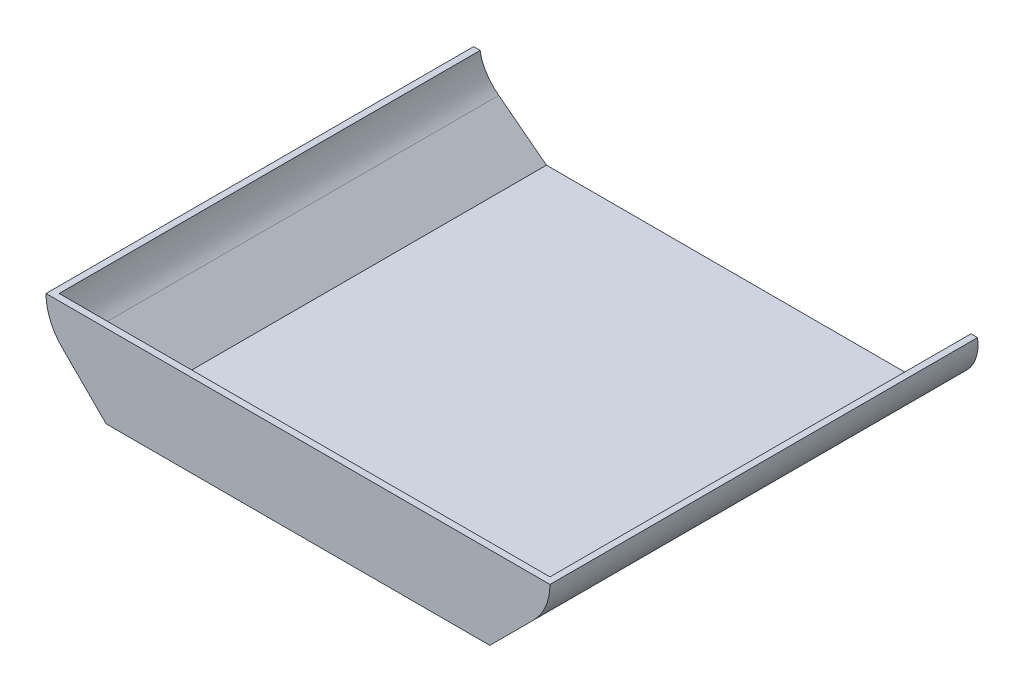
ISO-10303-21;
HEADER;
FILE_DESCRIPTION(('STEP AP214'),'2;1');
FILE_NAME('part.step','',(''),(''),'','','');
FILE_SCHEMA(('AUTOMOTIVE_DESIGN { 1 0 10303 214 1 1 1 1 }'));
ENDSEC;
DATA;
#1=APPLICATION_CONTEXT('core data for automotive mechanical design processes');
#2=APPLICATION_PROTOCOL_DEFINITION('international standard','automotive_design',2000,#1);
#3=PRODUCT_CONTEXT('',#1,'mechanical');
#4=PRODUCT('Part','Part','',(#3));
#5=PRODUCT_RELATED_PRODUCT_CATEGORY('part','',(#4));
#6=PRODUCT_DEFINITION_FORMATION('','',#4);
#7=PRODUCT_DEFINITION_CONTEXT('part definition',#1,'design');
#8=PRODUCT_DEFINITION('design','',#6,#7);
#9=PRODUCT_DEFINITION_SHAPE('','',#8);
#10=(LENGTH_UNIT() NAMED_UNIT(*) SI_UNIT(.MILLI.,.METRE.));
#11=(NAMED_UNIT(*) PLANE_ANGLE_UNIT() SI_UNIT($,.RADIAN.));
#12=(NAMED_UNIT(*) SI_UNIT($,.STERADIAN.) SOLID_ANGLE_UNIT());
#13=UNCERTAINTY_MEASURE_WITH_UNIT(LENGTH_MEASURE(1.E-05),#10,'distance_accuracy_value','');
#14=(GEOMETRIC_REPRESENTATION_CONTEXT(3) GLOBAL_UNCERTAINTY_ASSIGNED_CONTEXT((#13)) GLOBAL_UNIT_ASSIGNED_CONTEXT((#10,
#11,#12)) REPRESENTATION_CONTEXT('',''));
#15=CARTESIAN_POINT('',(0.,0.,0.));
#16=DIRECTION('',(0.,0.,1.));
#17=DIRECTION('',(1.,0.,0.));
#18=AXIS2_PLACEMENT_3D('',#15,#16,#17);
#19=CARTESIAN_POINT('',(175.,0.,400.));
#20=DIRECTION('',(-0.707106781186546,0.707106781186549,0.));
#21=DIRECTION('',(-0.707106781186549,-0.707106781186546,0.));
#22=AXIS2_PLACEMENT_3D('',#19,#20,#21);
#23=PLANE('',#22);
#24=DIRECTION('',(-0.704062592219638,-0.704062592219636,-0.0926915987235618));
#25=VECTOR('',#24,1.);
#26=CARTESIAN_POINT('',(201.104274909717,26.1042749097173,3.43669298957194));
#27=LINE('',#26,#25);
#28=CARTESIAN_POINT('',(215.218833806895,40.2188338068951,5.29490992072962));
#29=VERTEX_POINT('',#28);
#30=CARTESIAN_POINT('',(175.,0.,0.));
#31=VERTEX_POINT('',#30);
#32=EDGE_CURVE('E190',#29,#31,#27,.T.);
#33=ORIENTED_EDGE('',*,*,#32,.F.);
#34=DIRECTION('',(0.,0.,-1.));
#35=VECTOR('',#34,1.);
#36=CARTESIAN_POINT('',(215.218833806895,40.2188338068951,400.));
#37=LINE('',#36,#35);
#38=CARTESIAN_POINT('',(215.218833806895,40.2188338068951,400.));
#39=VERTEX_POINT('',#38);
#40=EDGE_CURVE('E11',#39,#29,#37,.T.);
#41=ORIENTED_EDGE('',*,*,#40,.F.);
#42=DIRECTION('',(0.707106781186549,0.707106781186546,0.));
#43=VECTOR('',#42,1.);
#44=CARTESIAN_POINT('',(175.,0.,400.));
#45=LINE('',#44,#43);
#46=CARTESIAN_POINT('',(175.,0.,400.));
#47=VERTEX_POINT('',#46);
#48=EDGE_CURVE('E194',#47,#39,#45,.T.);
#49=ORIENTED_EDGE('',*,*,#48,.F.);
#50=DIRECTION('',(0.,0.,-1.));
#51=VECTOR('',#50,1.);
#52=CARTESIAN_POINT('',(175.,0.,400.));
#53=LINE('',#52,#51);
#54=EDGE_CURVE('E204',#47,#31,#53,.T.);
#55=ORIENTED_EDGE('',*,*,#54,.T.);
#56=EDGE_LOOP('',(#33,#41,#49,#55));
#57=FACE_BOUND('',#56,.T.);
#58=ADVANCED_FACE('F39',(#57),#23,.F.);
#59=CARTESIAN_POINT('',(179.863494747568,75.5741728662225,400.));
#60=DIRECTION('',(0.,0.,-1.));
#61=DIRECTION('',(-1.,0.,0.));
#62=AXIS2_PLACEMENT_3D('',#59,#60,#61);
#63=CYLINDRICAL_SURFACE('',#62,50.);
#64=CARTESIAN_POINT('',(179.863494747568,75.5741728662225,9.94952861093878));
#65=DIRECTION('',(0.,0.130526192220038,-0.991444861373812));
#66=DIRECTION('',(0.,-0.991444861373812,-0.130526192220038));
#67=AXIS2_PLACEMENT_3D('',#64,#65,#66);
#68=ELLIPSE('',#67,50.4314480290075,50.);
#69=CARTESIAN_POINT('',(229.863494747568,75.5741721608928,9.94952851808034));
#70=VERTEX_POINT('',#69);
#71=EDGE_CURVE('E188',#70,#29,#68,.T.);
#72=ORIENTED_EDGE('',*,*,#71,.F.);
#73=DIRECTION('',(0.,0.,-1.));
#74=VECTOR('',#73,1.);
#75=CARTESIAN_POINT('',(229.863494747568,75.5741720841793,400.));
#76=LINE('',#75,#74);
#77=CARTESIAN_POINT('',(229.863494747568,75.5741720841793,400.));
#78=VERTEX_POINT('',#77);
#79=EDGE_CURVE('E47',#78,#70,#76,.T.);
#80=ORIENTED_EDGE('',*,*,#79,.F.);
#81=CARTESIAN_POINT('',(179.863494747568,75.5741728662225,400.));
#82=DIRECTION('',(0.,0.,1.));
#83=DIRECTION('',(1.,0.,0.));
#84=AXIS2_PLACEMENT_3D('',#81,#82,#83);
#85=CIRCLE('',#84,50.);
#86=EDGE_CURVE('E196',#39,#78,#85,.T.);
#87=ORIENTED_EDGE('',*,*,#86,.F.);
#88=ORIENTED_EDGE('',*,*,#40,.T.);
#89=EDGE_LOOP('',(#72,#80,#87,#88));
#90=FACE_BOUND('',#89,.T.);
#91=ADVANCED_FACE('F229',(#90),#63,.T.);
#92=CARTESIAN_POINT('',(-179.863494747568,75.5741728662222,400.));
#93=DIRECTION('',(0.,0.,-1.));
#94=DIRECTION('',(-1.,0.,0.));
#95=AXIS2_PLACEMENT_3D('',#92,#93,#94);
#96=CYLINDRICAL_SURFACE('',#95,50.);
#97=CARTESIAN_POINT('',(-179.863494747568,75.5741728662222,9.94952861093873));
#98=DIRECTION('',(0.,0.130526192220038,-0.991444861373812));
#99=DIRECTION('',(0.,-0.991444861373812,-0.130526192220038));
#100=AXIS2_PLACEMENT_3D('',#97,#98,#99);
#101=ELLIPSE('',#100,50.4314480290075,50.);
#102=CARTESIAN_POINT('',(-215.218833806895,40.2188338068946,5.29490992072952));
#103=VERTEX_POINT('',#102);
#104=CARTESIAN_POINT('',(-229.863494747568,75.5741721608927,9.94952851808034));
#105=VERTEX_POINT('',#104);
#106=EDGE_CURVE('E185',#103,#105,#101,.T.);
#107=ORIENTED_EDGE('',*,*,#106,.F.);
#108=DIRECTION('',(0.,0.,-1.));
#109=VECTOR('',#108,1.);
#110=CARTESIAN_POINT('',(-215.218833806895,40.2188338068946,400.));
#111=LINE('',#110,#109);
#112=CARTESIAN_POINT('',(-215.218833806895,40.2188338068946,400.));
#113=VERTEX_POINT('',#112);
#114=EDGE_CURVE('E212',#113,#103,#111,.T.);
#115=ORIENTED_EDGE('',*,*,#114,.F.);
#116=CARTESIAN_POINT('',(-179.863494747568,75.5741728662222,400.));
#117=DIRECTION('',(0.,0.,1.));
#118=DIRECTION('',(-1.,0.,0.));
#119=AXIS2_PLACEMENT_3D('',#116,#117,#118);
#120=CIRCLE('',#119,50.);
#121=CARTESIAN_POINT('',(-229.863494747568,75.5741720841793,400.));
#122=VERTEX_POINT('',#121);
#123=EDGE_CURVE('E199',#122,#113,#120,.T.);
#124=ORIENTED_EDGE('',*,*,#123,.F.);
#125=DIRECTION('',(0.,0.,-1.));
#126=VECTOR('',#125,1.);
#127=CARTESIAN_POINT('',(-229.863494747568,75.5741720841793,400.));
#128=LINE('',#127,#126);
#129=EDGE_CURVE('E215',#122,#105,#128,.T.);
#130=ORIENTED_EDGE('',*,*,#129,.T.);
#131=EDGE_LOOP('',(#107,#115,#124,#130));
#132=FACE_BOUND('',#131,.T.);
#133=ADVANCED_FACE('F243',(#132),#96,.T.);
#134=CARTESIAN_POINT('',(-175.,0.,400.));
#135=DIRECTION('',(0.707106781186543,0.707106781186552,0.));
#136=DIRECTION('',(-0.707106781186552,0.707106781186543,0.));
#137=AXIS2_PLACEMENT_3D('',#134,#135,#136);
#138=PLANE('',#137);
#139=DIRECTION('',(-0.704062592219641,0.704062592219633,0.0926915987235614));
#140=VECTOR('',#139,1.);
#141=CARTESIAN_POINT('',(-201.104274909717,26.1042749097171,3.43669298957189));
#142=LINE('',#141,#140);
#143=CARTESIAN_POINT('',(-175.,0.,0.));
#144=VERTEX_POINT('',#143);
#145=EDGE_CURVE('E183',#144,#103,#142,.T.);
#146=ORIENTED_EDGE('',*,*,#145,.F.);
#147=DIRECTION('',(0.,0.,-1.));
#148=VECTOR('',#147,1.);
#149=CARTESIAN_POINT('',(-175.,0.,400.));
#150=LINE('',#149,#148);
#151=CARTESIAN_POINT('',(-175.,0.,400.));
#152=VERTEX_POINT('',#151);
#153=EDGE_CURVE('E209',#152,#144,#150,.T.);
#154=ORIENTED_EDGE('',*,*,#153,.F.);
#155=DIRECTION('',(0.707106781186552,-0.707106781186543,0.));
#156=VECTOR('',#155,1.);
#157=CARTESIAN_POINT('',(-175.,0.,400.));
#158=LINE('',#157,#156);
#159=EDGE_CURVE('E201',#113,#152,#158,.T.);
#160=ORIENTED_EDGE('',*,*,#159,.F.);
#161=ORIENTED_EDGE('',*,*,#114,.T.);
#162=EDGE_LOOP('',(#146,#154,#160,#161));
#163=FACE_BOUND('',#162,.T.);
#164=ADVANCED_FACE('F239',(#163),#138,.F.);
#165=CARTESIAN_POINT('',(-175.,0.,400.));
#166=DIRECTION('',(0.,1.,0.));
#167=DIRECTION('',(-1.,0.,0.));
#168=AXIS2_PLACEMENT_3D('',#165,#166,#167);
#169=PLANE('',#168);
#170=DIRECTION('',(1.,0.,0.));
#171=VECTOR('',#170,1.);
#172=CARTESIAN_POINT('',(-175.,0.,0.));
#173=LINE('',#172,#171);
#174=EDGE_CURVE('E193',#144,#31,#173,.T.);
#175=ORIENTED_EDGE('',*,*,#174,.T.);
#176=ORIENTED_EDGE('',*,*,#54,.F.);
#177=DIRECTION('',(1.,0.,0.));
#178=VECTOR('',#177,1.);
#179=CARTESIAN_POINT('',(-175.,0.,400.));
#180=LINE('',#179,#178);
#181=EDGE_CURVE('E54',#152,#47,#180,.T.);
#182=ORIENTED_EDGE('',*,*,#181,.F.);
#183=ORIENTED_EDGE('',*,*,#153,.T.);
#184=EDGE_LOOP('',(#175,#176,#182,#183));
#185=FACE_BOUND('',#184,.T.);
#186=ADVANCED_FACE('F235',(#185),#169,.F.);
#187=CARTESIAN_POINT('',(179.863494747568,75.5741728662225,400.));
#188=DIRECTION('',(0.,0.,1.));
#189=DIRECTION('',(1.,0.,0.));
#190=AXIS2_PLACEMENT_3D('',#187,#188,#189);
#191=PLANE('',#190);
#192=DIRECTION('',(1.,0.,0.));
#193=VECTOR('',#192,1.);
#194=CARTESIAN_POINT('',(-310.,75.5741720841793,400.));
#195=LINE('',#194,#193);
#196=EDGE_CURVE('E181',#122,#78,#195,.T.);
#197=ORIENTED_EDGE('',*,*,#196,.F.);
#198=ORIENTED_EDGE('',*,*,#123,.T.);
#199=ORIENTED_EDGE('',*,*,#159,.T.);
#200=ORIENTED_EDGE('',*,*,#181,.T.);
#201=ORIENTED_EDGE('',*,*,#48,.T.);
#202=ORIENTED_EDGE('',*,*,#86,.T.);
#203=EDGE_LOOP('',(#197,#198,#199,#200,#201,#202));
#204=FACE_BOUND('',#203,.T.);
#205=ADVANCED_FACE('F245',(#204),#191,.T.);
#206=CARTESIAN_POINT('',(0.,0.,0.));
#207=DIRECTION('',(0.,0.130526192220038,-0.991444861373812));
#208=DIRECTION('',(0.,0.991444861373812,0.130526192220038));
#209=AXIS2_PLACEMENT_3D('',#206,#207,#208);
#210=PLANE('',#209);
#211=DIRECTION('',(-1.,0.,0.));
#212=VECTOR('',#211,1.);
#213=CARTESIAN_POINT('',(0.,75.5741721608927,9.94952851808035));
#214=LINE('',#213,#212);
#215=CARTESIAN_POINT('',(223.863494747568,75.5741721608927,9.94952851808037));
#216=VERTEX_POINT('',#215);
#217=EDGE_CURVE('E133',#70,#216,#214,.T.);
#218=ORIENTED_EDGE('',*,*,#217,.F.);
#219=ORIENTED_EDGE('',*,*,#71,.T.);
#220=ORIENTED_EDGE('',*,*,#32,.T.);
#221=ORIENTED_EDGE('',*,*,#174,.F.);
#222=ORIENTED_EDGE('',*,*,#145,.T.);
#223=ORIENTED_EDGE('',*,*,#106,.T.);
#224=CARTESIAN_POINT('',(-223.863494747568,75.5741721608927,9.94952851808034));
#225=VERTEX_POINT('',#224);
#226=EDGE_CURVE('E227',#225,#105,#214,.T.);
#227=ORIENTED_EDGE('',*,*,#226,.F.);
#228=CARTESIAN_POINT('',(-179.863494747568,75.5741728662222,9.94952861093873));
#229=DIRECTION('',(0.,0.130526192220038,-0.991444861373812));
#230=DIRECTION('',(0.,-0.991444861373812,-0.130526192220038));
#231=AXIS2_PLACEMENT_3D('',#228,#229,#230);
#232=ELLIPSE('',#231,44.3796742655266,44.);
#233=CARTESIAN_POINT('',(-210.976193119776,44.4614744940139,5.85346416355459));
#234=VERTEX_POINT('',#233);
#235=EDGE_CURVE('E142',#234,#225,#232,.T.);
#236=ORIENTED_EDGE('',*,*,#235,.F.);
#237=DIRECTION('',(-0.704062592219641,0.704062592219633,0.0926915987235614));
#238=VECTOR('',#237,1.);
#239=CARTESIAN_POINT('',(-196.825182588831,30.3104639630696,3.99044828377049));
#240=LINE('',#239,#238);
#241=CARTESIAN_POINT('',(-172.514718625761,6.,0.789914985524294));
#242=VERTEX_POINT('',#241);
#243=EDGE_CURVE('E132',#242,#234,#240,.T.);
#244=ORIENTED_EDGE('',*,*,#243,.F.);
#245=DIRECTION('',(1.,0.,0.));
#246=VECTOR('',#245,1.);
#247=CARTESIAN_POINT('',(0.,6.,0.789914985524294));
#248=LINE('',#247,#246);
#249=CARTESIAN_POINT('',(172.514718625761,6.,0.789914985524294));
#250=VERTEX_POINT('',#249);
#251=EDGE_CURVE('E166',#242,#250,#248,.T.);
#252=ORIENTED_EDGE('',*,*,#251,.T.);
#253=DIRECTION('',(-0.704062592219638,-0.704062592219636,-0.0926915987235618));
#254=VECTOR('',#253,1.);
#255=CARTESIAN_POINT('',(196.825182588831,30.3104639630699,3.99044828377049));
#256=LINE('',#255,#254);
#257=CARTESIAN_POINT('',(210.976193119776,44.4614744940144,5.85346416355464));
#258=VERTEX_POINT('',#257);
#259=EDGE_CURVE('E164',#258,#250,#256,.T.);
#260=ORIENTED_EDGE('',*,*,#259,.F.);
#261=CARTESIAN_POINT('',(179.863494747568,75.5741728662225,9.94952861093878));
#262=DIRECTION('',(0.,0.130526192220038,-0.991444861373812));
#263=DIRECTION('',(0.,-0.991444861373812,-0.130526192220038));
#264=AXIS2_PLACEMENT_3D('',#261,#262,#263);
#265=ELLIPSE('',#264,44.3796742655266,44.);
#266=EDGE_CURVE('E167',#216,#258,#265,.T.);
#267=ORIENTED_EDGE('',*,*,#266,.F.);
#268=EDGE_LOOP('',(#218,#219,#220,#221,#222,#223,#227,#236,#244,#252,#260,#267));
#269=FACE_BOUND('',#268,.T.);
#270=ADVANCED_FACE('F224',(#269),#210,.T.);
#271=CARTESIAN_POINT('',(170.757359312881,4.24264068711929,400.));
#272=DIRECTION('',(-0.707106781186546,0.707106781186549,0.));
#273=DIRECTION('',(-0.707106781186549,-0.707106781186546,0.));
#274=AXIS2_PLACEMENT_3D('',#271,#272,#273);
#275=PLANE('',#274);
#276=ORIENTED_EDGE('',*,*,#259,.T.);
#277=DIRECTION('',(0.,0.,-1.));
#278=VECTOR('',#277,1.);
#279=CARTESIAN_POINT('',(172.514718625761,6.,400.));
#280=LINE('',#279,#278);
#281=CARTESIAN_POINT('',(172.514718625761,6.,394.));
#282=VERTEX_POINT('',#281);
#283=EDGE_CURVE('E156',#282,#250,#280,.T.);
#284=ORIENTED_EDGE('',*,*,#283,.F.);
#285=DIRECTION('',(0.707106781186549,0.707106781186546,0.));
#286=VECTOR('',#285,1.);
#287=CARTESIAN_POINT('',(170.757359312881,4.24264068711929,394.));
#288=LINE('',#287,#286);
#289=CARTESIAN_POINT('',(210.976193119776,44.4614744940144,394.));
#290=VERTEX_POINT('',#289);
#291=EDGE_CURVE('E153',#282,#290,#288,.T.);
#292=ORIENTED_EDGE('',*,*,#291,.T.);
#293=DIRECTION('',(0.,0.,-1.));
#294=VECTOR('',#293,1.);
#295=CARTESIAN_POINT('',(210.976193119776,44.4614744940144,400.));
#296=LINE('',#295,#294);
#297=EDGE_CURVE('E178',#290,#258,#296,.T.);
#298=ORIENTED_EDGE('',*,*,#297,.T.);
#299=EDGE_LOOP('',(#276,#284,#292,#298));
#300=FACE_BOUND('',#299,.T.);
#301=ADVANCED_FACE('F252',(#300),#275,.T.);
#302=CARTESIAN_POINT('',(179.863494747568,75.5741728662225,400.));
#303=DIRECTION('',(0.,0.,-1.));
#304=DIRECTION('',(-1.,0.,0.));
#305=AXIS2_PLACEMENT_3D('',#302,#303,#304);
#306=CYLINDRICAL_SURFACE('',#305,44.);
#307=ORIENTED_EDGE('',*,*,#266,.T.);
#308=ORIENTED_EDGE('',*,*,#297,.F.);
#309=CARTESIAN_POINT('',(179.863494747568,75.5741728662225,394.));
#310=DIRECTION('',(0.,0.,1.));
#311=DIRECTION('',(1.,0.,0.));
#312=AXIS2_PLACEMENT_3D('',#309,#310,#311);
#313=CIRCLE('',#312,44.);
#314=CARTESIAN_POINT('',(223.863494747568,75.5741721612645,394.));
#315=VERTEX_POINT('',#314);
#316=EDGE_CURVE('E149',#290,#315,#313,.T.);
#317=ORIENTED_EDGE('',*,*,#316,.T.);
#318=DIRECTION('',(0.,0.,-1.));
#319=VECTOR('',#318,1.);
#320=CARTESIAN_POINT('',(223.863494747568,75.5741721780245,400.));
#321=LINE('',#320,#319);
#322=EDGE_CURVE('E128',#315,#216,#321,.T.);
#323=ORIENTED_EDGE('',*,*,#322,.T.);
#324=EDGE_LOOP('',(#307,#308,#317,#323));
#325=FACE_BOUND('',#324,.T.);
#326=ADVANCED_FACE('F284',(#325),#306,.F.);
#327=CARTESIAN_POINT('',(-179.863494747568,75.5741728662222,400.));
#328=DIRECTION('',(0.,0.,-1.));
#329=DIRECTION('',(-1.,0.,0.));
#330=AXIS2_PLACEMENT_3D('',#327,#328,#329);
#331=CYLINDRICAL_SURFACE('',#330,44.);
#332=ORIENTED_EDGE('',*,*,#235,.T.);
#333=DIRECTION('',(0.,0.,-1.));
#334=VECTOR('',#333,1.);
#335=CARTESIAN_POINT('',(-223.863494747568,75.5741721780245,400.));
#336=LINE('',#335,#334);
#337=CARTESIAN_POINT('',(-223.863494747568,75.5741720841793,394.));
#338=VERTEX_POINT('',#337);
#339=EDGE_CURVE('E125',#338,#225,#336,.T.);
#340=ORIENTED_EDGE('',*,*,#339,.F.);
#341=CARTESIAN_POINT('',(-179.863494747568,75.5741728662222,394.));
#342=DIRECTION('',(0.,0.,1.));
#343=DIRECTION('',(1.,0.,0.));
#344=AXIS2_PLACEMENT_3D('',#341,#342,#343);
#345=CIRCLE('',#344,44.);
#346=CARTESIAN_POINT('',(-210.976193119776,44.4614744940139,394.));
#347=VERTEX_POINT('',#346);
#348=EDGE_CURVE('E139',#338,#347,#345,.T.);
#349=ORIENTED_EDGE('',*,*,#348,.T.);
#350=DIRECTION('',(0.,0.,1.));
#351=VECTOR('',#350,1.);
#352=CARTESIAN_POINT('',(-210.976193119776,44.4614744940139,400.));
#353=LINE('',#352,#351);
#354=EDGE_CURVE('E143',#347,#234,#353,.F.);
#355=ORIENTED_EDGE('',*,*,#354,.T.);
#356=EDGE_LOOP('',(#332,#340,#349,#355));
#357=FACE_BOUND('',#356,.T.);
#358=ADVANCED_FACE('F137',(#357),#331,.F.);
#359=CARTESIAN_POINT('',(-170.757359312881,4.24264068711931,400.));
#360=DIRECTION('',(0.707106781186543,0.707106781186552,0.));
#361=DIRECTION('',(-0.707106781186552,0.707106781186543,0.));
#362=AXIS2_PLACEMENT_3D('',#359,#360,#361);
#363=PLANE('',#362);
#364=ORIENTED_EDGE('',*,*,#243,.T.);
#365=ORIENTED_EDGE('',*,*,#354,.F.);
#366=DIRECTION('',(0.707106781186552,-0.707106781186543,0.));
#367=VECTOR('',#366,1.);
#368=CARTESIAN_POINT('',(-170.757359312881,4.24264068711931,394.));
#369=LINE('',#368,#367);
#370=CARTESIAN_POINT('',(-172.514718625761,6.,394.));
#371=VERTEX_POINT('',#370);
#372=EDGE_CURVE('E148',#347,#371,#369,.T.);
#373=ORIENTED_EDGE('',*,*,#372,.T.);
#374=DIRECTION('',(0.,0.,-1.));
#375=VECTOR('',#374,1.);
#376=CARTESIAN_POINT('',(-172.514718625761,6.,400.));
#377=LINE('',#376,#375);
#378=EDGE_CURVE('E161',#371,#242,#377,.T.);
#379=ORIENTED_EDGE('',*,*,#378,.T.);
#380=EDGE_LOOP('',(#364,#365,#373,#379));
#381=FACE_BOUND('',#380,.T.);
#382=ADVANCED_FACE('F294',(#381),#363,.T.);
#383=CARTESIAN_POINT('',(-175.,6.,400.));
#384=DIRECTION('',(0.,1.,0.));
#385=DIRECTION('',(-1.,0.,0.));
#386=AXIS2_PLACEMENT_3D('',#383,#384,#385);
#387=PLANE('',#386);
#388=ORIENTED_EDGE('',*,*,#251,.F.);
#389=ORIENTED_EDGE('',*,*,#378,.F.);
#390=DIRECTION('',(1.,0.,0.));
#391=VECTOR('',#390,1.);
#392=CARTESIAN_POINT('',(-175.,6.,394.));
#393=LINE('',#392,#391);
#394=EDGE_CURVE('E151',#371,#282,#393,.T.);
#395=ORIENTED_EDGE('',*,*,#394,.T.);
#396=ORIENTED_EDGE('',*,*,#283,.T.);
#397=EDGE_LOOP('',(#388,#389,#395,#396));
#398=FACE_BOUND('',#397,.T.);
#399=ADVANCED_FACE('F299',(#398),#387,.T.);
#400=CARTESIAN_POINT('',(179.863494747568,75.5741728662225,394.));
#401=DIRECTION('',(0.,0.,1.));
#402=DIRECTION('',(1.,0.,0.));
#403=AXIS2_PLACEMENT_3D('',#400,#401,#402);
#404=PLANE('',#403);
#405=DIRECTION('',(1.,0.,0.));
#406=VECTOR('',#405,1.);
#407=CARTESIAN_POINT('',(-310.,75.5741720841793,394.));
#408=LINE('',#407,#406);
#409=EDGE_CURVE('E122',#338,#315,#408,.T.);
#410=ORIENTED_EDGE('',*,*,#409,.T.);
#411=ORIENTED_EDGE('',*,*,#316,.F.);
#412=ORIENTED_EDGE('',*,*,#291,.F.);
#413=ORIENTED_EDGE('',*,*,#394,.F.);
#414=ORIENTED_EDGE('',*,*,#372,.F.);
#415=ORIENTED_EDGE('',*,*,#348,.F.);
#416=EDGE_LOOP('',(#410,#411,#412,#413,#414,#415));
#417=FACE_BOUND('',#416,.T.);
#418=ADVANCED_FACE('F146',(#417),#404,.F.);
#419=CARTESIAN_POINT('',(-239.863494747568,75.5741721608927,-1.2E-05));
#420=DIRECTION('',(0.,-1.,0.));
#421=DIRECTION('',(0.,0.,-1.));
#422=AXIS2_PLACEMENT_3D('',#419,#420,#421);
#423=PLANE('',#422);
#424=ORIENTED_EDGE('',*,*,#217,.T.);
#425=ORIENTED_EDGE('',*,*,#322,.F.);
#426=ORIENTED_EDGE('',*,*,#409,.F.);
#427=ORIENTED_EDGE('',*,*,#339,.T.);
#428=ORIENTED_EDGE('',*,*,#226,.T.);
#429=ORIENTED_EDGE('',*,*,#129,.F.);
#430=ORIENTED_EDGE('',*,*,#196,.T.);
#431=ORIENTED_EDGE('',*,*,#79,.T.);
#432=EDGE_LOOP('',(#424,#425,#426,#427,#428,#429,#430,#431));
#433=FACE_BOUND('',#432,.T.);
#434=ADVANCED_FACE('F124',(#433),#423,.F.);
#435=CLOSED_SHELL('',(#58,#91,#133,#164,#186,#205,#270,#301,#326,#358,#382,#399,#418,#434));
#436=MANIFOLD_SOLID_BREP('B2',#435);
#437=ADVANCED_BREP_SHAPE_REPRESENTATION('',(#18,#436),#14);
#438=SHAPE_DEFINITION_REPRESENTATION(#9,#437);
ENDSEC;
END-ISO-10303-21;
